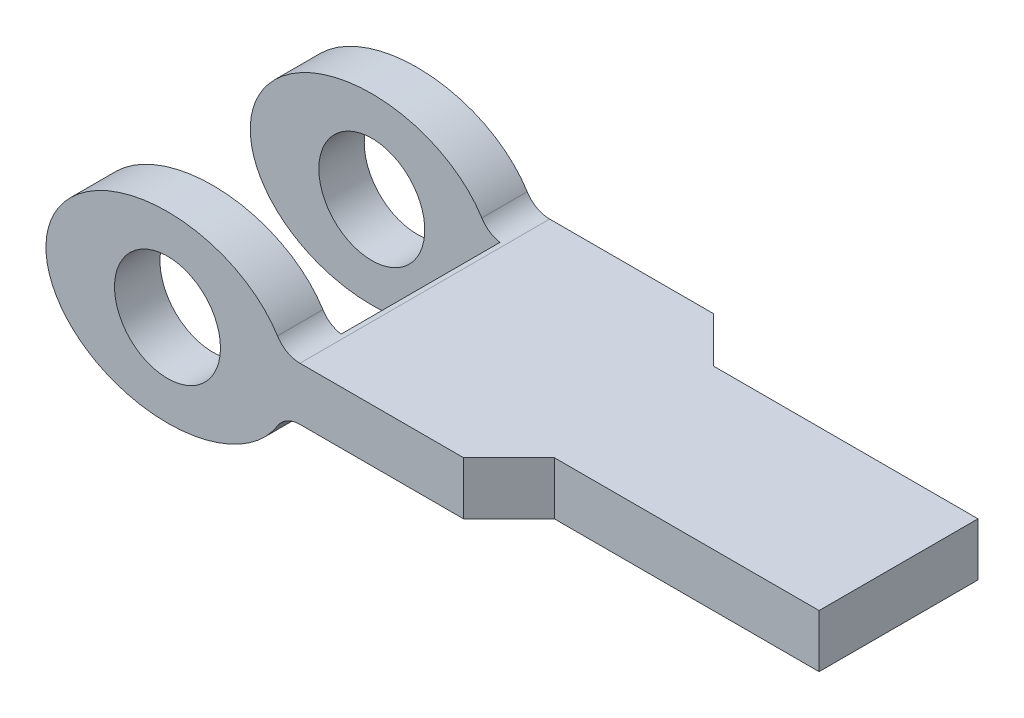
from build123d import *

# Parameters (mm, degrees)
SZKIC1_R                        = 4
DODANIE_WYCI_GNI_CIE1_DEPTH     = 9.428571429
WYTNIJ_WYCI_GNI_CIE1_DEPTH      = 48.246682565
WYTNIJ_WYCI_GNI_CIE1_DEPTH_BACK = 48.246682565
SZKIC2_W                        = 19.355922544
SZKIC2_H                        = 12
WYTNIJ_WYCI_GNI_CIE2_DEPTH      = 48.246682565
WYTNIJ_WYCI_GNI_CIE2_DEPTH_BACK = 48.246682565


with BuildPart() as part:
    # Szkic1 → Dodanie-wyci_gni_cie1 (new, symmetric)
    with BuildSketch(Plane.XY):
        with BuildLine():
            Line((10.003566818, 2), (45.776749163, 2))
            Line((45.776749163, 2), (45.776749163, -2))
            Line((45.776749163, -2), (10.003566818, -2))
            ThreePointArc((10.003566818, -2), (9.033131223, -2.251213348), (8.306482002, -2.941745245))
            add(Edge.make_bspline(
                [(8.306482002, 2.941745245), (3.379748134, 10.842569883), (-5.699633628, 5.421284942), (-14.77901539, 0), (-5.699633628, -5.421284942), (3.379748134, -10.842569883), (8.306482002, -2.941745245)],
                knots=[3.58089987, 3.58089987, 3.58089987, 5.382423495, 5.382423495, 7.18394712, 7.18394712, 8.985470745, 8.985470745, 8.985470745], degree=2, weights=[1, 0.62101304, 1, 0.62101304, 1, 0.62101304, 1]))
            ThreePointArc((8.306482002, 2.941745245), (9.033131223, 2.251213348), (10.003566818, 2))
        make_face()
        Circle(SZKIC1_R, mode=Mode.SUBTRACT)
    extrude(amount=DODANIE_WYCI_GNI_CIE1_DEPTH, both=True)

    # Szkic2 → Wytnij-wyci_gni_cie1 (cut, two sides: drawn at the far end of the back side and taken through both)
    with BuildSketch(Plane(origin=(0, 0, 0), x_dir=(1, 0, 0), z_dir=(0, 1, 0)).offset(-WYTNIJ_WYCI_GNI_CIE1_DEPTH_BACK)):
        Rectangle(SZKIC2_W, SZKIC2_H)
    extrude(amount=WYTNIJ_WYCI_GNI_CIE1_DEPTH + WYTNIJ_WYCI_GNI_CIE1_DEPTH_BACK, mode=Mode.SUBTRACT)

    # Szkic3 → Wytnij-wyci_gni_cie2 (cut, two sides: drawn at the far end of the back side and taken through both)
    with BuildSketch(Plane(origin=(0, 0, 0), x_dir=(1, 0, 0), z_dir=(0, 1, 0)).offset(-WYTNIJ_WYCI_GNI_CIE2_DEPTH_BACK)):
        Polygon((22.355922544, 9.428571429), (25.784493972, 6), (45.776749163, 6), (45.776749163, 9.428571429), align=None)
        Polygon((22.355922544, -9.428571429), (25.784493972, -6), (45.776749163, -6), (45.776749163, -9.428571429), align=None)
    extrude(amount=WYTNIJ_WYCI_GNI_CIE2_DEPTH + WYTNIJ_WYCI_GNI_CIE2_DEPTH_BACK, mode=Mode.SUBTRACT)


solid = part.part
